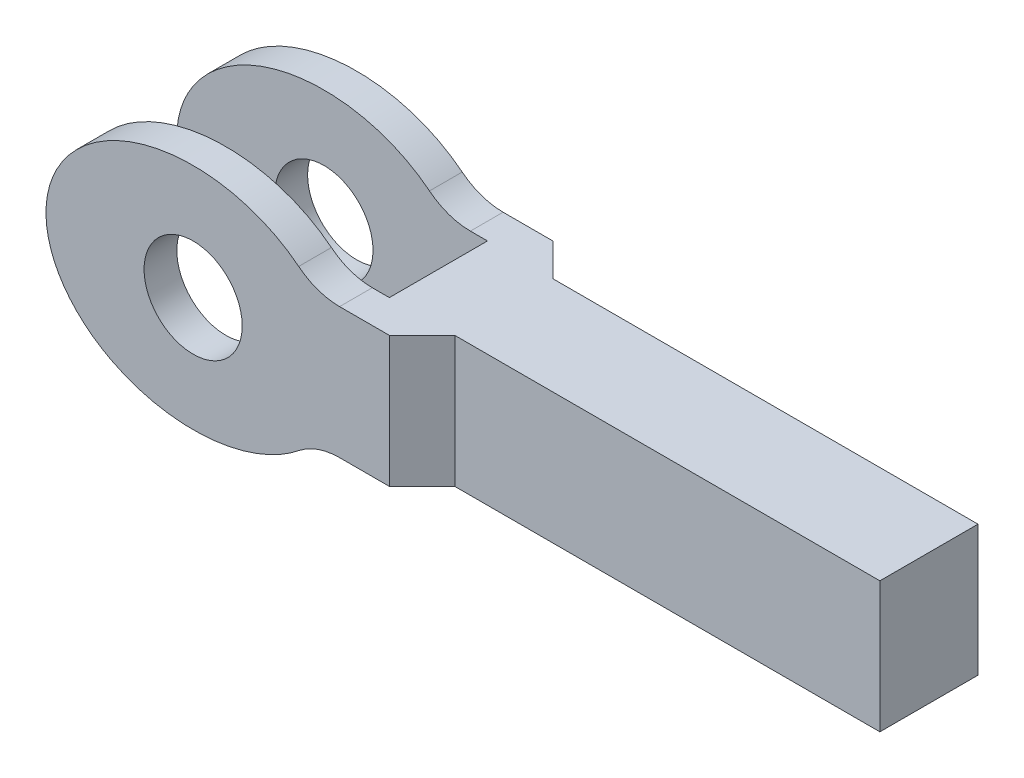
ISO-10303-21;
HEADER;
FILE_DESCRIPTION(('STEP AP214'),'2;1');
FILE_NAME('part.step','',(''),(''),'','','');
FILE_SCHEMA(('AUTOMOTIVE_DESIGN { 1 0 10303 214 1 1 1 1 }'));
ENDSEC;
DATA;
#1=APPLICATION_CONTEXT('core data for automotive mechanical design processes');
#2=APPLICATION_PROTOCOL_DEFINITION('international standard','automotive_design',2000,#1);
#3=PRODUCT_CONTEXT('',#1,'mechanical');
#4=PRODUCT('Part','Part','',(#3));
#5=PRODUCT_RELATED_PRODUCT_CATEGORY('part','',(#4));
#6=PRODUCT_DEFINITION_FORMATION('','',#4);
#7=PRODUCT_DEFINITION_CONTEXT('part definition',#1,'design');
#8=PRODUCT_DEFINITION('design','',#6,#7);
#9=PRODUCT_DEFINITION_SHAPE('','',#8);
#10=(LENGTH_UNIT() NAMED_UNIT(*) SI_UNIT(.MILLI.,.METRE.));
#11=(NAMED_UNIT(*) PLANE_ANGLE_UNIT() SI_UNIT($,.RADIAN.));
#12=(NAMED_UNIT(*) SI_UNIT($,.STERADIAN.) SOLID_ANGLE_UNIT());
#13=UNCERTAINTY_MEASURE_WITH_UNIT(LENGTH_MEASURE(1.E-05),#10,'distance_accuracy_value','');
#14=(GEOMETRIC_REPRESENTATION_CONTEXT(3) GLOBAL_UNCERTAINTY_ASSIGNED_CONTEXT((#13)) GLOBAL_UNIT_ASSIGNED_CONTEXT((#10,
#11,#12)) REPRESENTATION_CONTEXT('',''));
#15=CARTESIAN_POINT('',(0.,0.,0.));
#16=DIRECTION('',(0.,0.,1.));
#17=DIRECTION('',(1.,0.,0.));
#18=AXIS2_PLACEMENT_3D('',#15,#16,#17);
#19=CARTESIAN_POINT('',(4.47775645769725,-4.00000000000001,2.5));
#20=DIRECTION('',(0.,0.,-1.));
#21=DIRECTION('',(-1.,0.,0.));
#22=AXIS2_PLACEMENT_3D('',#19,#20,#21);
#23=CYLINDRICAL_SURFACE('',#22,2.);
#24=DIRECTION('',(0.,0.,-1.));
#25=VECTOR('',#24,1.);
#26=CARTESIAN_POINT('',(4.47775645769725,-2.,2.5));
#27=LINE('',#26,#25);
#28=CARTESIAN_POINT('',(4.47775645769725,-2.,-1.5));
#29=VERTEX_POINT('',#28);
#30=CARTESIAN_POINT('',(4.47775645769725,-2.,-2.5));
#31=VERTEX_POINT('',#30);
#32=EDGE_CURVE('E167',#29,#31,#27,.T.);
#33=ORIENTED_EDGE('',*,*,#32,.F.);
#34=CARTESIAN_POINT('',(4.47775645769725,-4.00000000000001,-1.5));
#35=DIRECTION('',(0.,0.,-1.));
#36=DIRECTION('',(-1.,0.,0.));
#37=AXIS2_PLACEMENT_3D('',#34,#35,#36);
#38=CIRCLE('',#37,2.);
#39=CARTESIAN_POINT('',(3.2277484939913,-2.43875687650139,-1.5));
#40=VERTEX_POINT('',#39);
#41=EDGE_CURVE('E237',#29,#40,#38,.F.);
#42=ORIENTED_EDGE('',*,*,#41,.T.);
#43=DIRECTION('',(0.,0.,-1.));
#44=VECTOR('',#43,1.);
#45=CARTESIAN_POINT('',(3.2277484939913,-2.43875687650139,2.5));
#46=LINE('',#45,#44);
#47=CARTESIAN_POINT('',(3.2277484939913,-2.43875687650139,-2.5));
#48=VERTEX_POINT('',#47);
#49=EDGE_CURVE('E267',#40,#48,#46,.T.);
#50=ORIENTED_EDGE('',*,*,#49,.T.);
#51=CARTESIAN_POINT('',(4.47775645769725,-4.00000000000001,-2.5));
#52=DIRECTION('',(0.,0.,-1.));
#53=DIRECTION('',(1.,0.,0.));
#54=AXIS2_PLACEMENT_3D('',#51,#52,#53);
#55=CIRCLE('',#54,2.);
#56=EDGE_CURVE('E250',#48,#31,#55,.T.);
#57=ORIENTED_EDGE('',*,*,#56,.T.);
#58=EDGE_LOOP('',(#33,#42,#50,#57));
#59=FACE_BOUND('',#58,.T.);
#60=ADVANCED_FACE('F33',(#59),#23,.F.);
#61=CARTESIAN_POINT('',(4.47775645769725,4.00000000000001,2.5));
#62=DIRECTION('',(0.,0.,-1.));
#63=DIRECTION('',(-1.,0.,0.));
#64=AXIS2_PLACEMENT_3D('',#61,#62,#63);
#65=CYLINDRICAL_SURFACE('',#64,2.);
#66=DIRECTION('',(0.,0.,-1.));
#67=VECTOR('',#66,1.);
#68=CARTESIAN_POINT('',(3.2277484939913,2.43875687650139,2.5));
#69=LINE('',#68,#67);
#70=CARTESIAN_POINT('',(3.2277484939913,2.43875687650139,-1.5));
#71=VERTEX_POINT('',#70);
#72=CARTESIAN_POINT('',(3.2277484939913,2.43875687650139,-2.5));
#73=VERTEX_POINT('',#72);
#74=EDGE_CURVE('E320',#71,#73,#69,.T.);
#75=ORIENTED_EDGE('',*,*,#74,.F.);
#76=CARTESIAN_POINT('',(4.47775645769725,4.00000000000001,-1.5));
#77=DIRECTION('',(0.,0.,-1.));
#78=DIRECTION('',(-1.,0.,0.));
#79=AXIS2_PLACEMENT_3D('',#76,#77,#78);
#80=CIRCLE('',#79,2.);
#81=CARTESIAN_POINT('',(4.47775645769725,2.,-1.5));
#82=VERTEX_POINT('',#81);
#83=EDGE_CURVE('E231',#71,#82,#80,.F.);
#84=ORIENTED_EDGE('',*,*,#83,.T.);
#85=DIRECTION('',(0.,0.,-1.));
#86=VECTOR('',#85,1.);
#87=CARTESIAN_POINT('',(4.47775645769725,2.,2.5));
#88=LINE('',#87,#86);
#89=CARTESIAN_POINT('',(4.47775645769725,2.,-2.5));
#90=VERTEX_POINT('',#89);
#91=EDGE_CURVE('E323',#82,#90,#88,.T.);
#92=ORIENTED_EDGE('',*,*,#91,.T.);
#93=CARTESIAN_POINT('',(4.47775645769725,4.00000000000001,-2.5));
#94=DIRECTION('',(0.,0.,-1.));
#95=DIRECTION('',(-1.,0.,0.));
#96=AXIS2_PLACEMENT_3D('',#93,#94,#95);
#97=CIRCLE('',#96,2.);
#98=EDGE_CURVE('E310',#90,#73,#97,.T.);
#99=ORIENTED_EDGE('',*,*,#98,.T.);
#100=EDGE_LOOP('',(#75,#84,#92,#99));
#101=FACE_BOUND('',#100,.T.);
#102=ADVANCED_FACE('F283',(#101),#65,.F.);
#103=CARTESIAN_POINT('',(0.,0.,2.5));
#104=DIRECTION('',(0.,0.,1.));
#105=DIRECTION('',(-1.,0.,0.));
#106=AXIS2_PLACEMENT_3D('',#103,#104,#105);
#107=ELLIPSE('',#106,4.5,3.5);
#108=DIRECTION('',(0.,0.,-1.));
#109=VECTOR('',#108,1.);
#110=SURFACE_OF_LINEAR_EXTRUSION('',#107,#109);
#111=CARTESIAN_POINT('',(0.,0.,-1.5));
#112=DIRECTION('',(0.,0.,1.));
#113=DIRECTION('',(-1.,0.,0.));
#114=AXIS2_PLACEMENT_3D('',#111,#112,#113);
#115=ELLIPSE('',#114,4.5,3.5);
#116=EDGE_CURVE('E185',#40,#71,#115,.F.);
#117=ORIENTED_EDGE('',*,*,#116,.T.);
#118=ORIENTED_EDGE('',*,*,#74,.T.);
#119=CARTESIAN_POINT('',(0.,0.,-2.5));
#120=DIRECTION('',(0.,0.,1.));
#121=DIRECTION('',(-1.,0.,0.));
#122=AXIS2_PLACEMENT_3D('',#119,#120,#121);
#123=ELLIPSE('',#122,4.5,3.5);
#124=EDGE_CURVE('E257',#73,#48,#123,.T.);
#125=ORIENTED_EDGE('',*,*,#124,.T.);
#126=ORIENTED_EDGE('',*,*,#49,.F.);
#127=EDGE_LOOP('',(#117,#118,#125,#126));
#128=FACE_BOUND('',#127,.T.);
#129=ADVANCED_FACE('F277',(#128),#110,.F.);
#130=CARTESIAN_POINT('',(0.,0.,2.5));
#131=DIRECTION('',(0.,0.,-1.));
#132=DIRECTION('',(-1.,0.,0.));
#133=AXIS2_PLACEMENT_3D('',#130,#131,#132);
#134=CYLINDRICAL_SURFACE('',#133,1.5);
#135=CARTESIAN_POINT('',(0.,0.,-1.5));
#136=DIRECTION('',(0.,0.,-1.));
#137=DIRECTION('',(-1.,0.,0.));
#138=AXIS2_PLACEMENT_3D('',#135,#136,#137);
#139=CIRCLE('',#138,1.5);
#140=CARTESIAN_POINT('',(-1.5,0.,-1.5));
#141=VERTEX_POINT('',#140);
#142=EDGE_CURVE('E182',#141,#141,#139,.T.);
#143=ORIENTED_EDGE('',*,*,#142,.F.);
#144=EDGE_LOOP('',(#143));
#145=FACE_BOUND('',#144,.T.);
#146=CARTESIAN_POINT('',(0.,0.,-2.5));
#147=DIRECTION('',(0.,0.,1.));
#148=DIRECTION('',(1.,0.,0.));
#149=AXIS2_PLACEMENT_3D('',#146,#147,#148);
#150=CIRCLE('',#149,1.5);
#151=CARTESIAN_POINT('',(1.5,0.,-2.5));
#152=VERTEX_POINT('',#151);
#153=EDGE_CURVE('E246',#152,#152,#150,.T.);
#154=ORIENTED_EDGE('',*,*,#153,.F.);
#155=EDGE_LOOP('',(#154));
#156=FACE_BOUND('',#155,.T.);
#157=ADVANCED_FACE('F351',(#145,#156),#134,.F.);
#158=CARTESIAN_POINT('',(0.,0.,2.5));
#159=DIRECTION('',(0.,0.,1.));
#160=DIRECTION('',(1.,0.,0.));
#161=AXIS2_PLACEMENT_3D('',#158,#159,#160);
#162=PLANE('',#161);
#163=DIRECTION('',(0.,1.,0.));
#164=VECTOR('',#163,1.);
#165=CARTESIAN_POINT('',(6.,-3.5,2.5));
#166=LINE('',#165,#164);
#167=CARTESIAN_POINT('',(6.,-2.,2.5));
#168=VERTEX_POINT('',#167);
#169=CARTESIAN_POINT('',(6.,2.,2.5));
#170=VERTEX_POINT('',#169);
#171=EDGE_CURVE('E153',#168,#170,#166,.T.);
#172=ORIENTED_EDGE('',*,*,#171,.T.);
#173=DIRECTION('',(-1.,0.,0.));
#174=VECTOR('',#173,1.);
#175=CARTESIAN_POINT('',(4.47775645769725,2.,2.5));
#176=LINE('',#175,#174);
#177=CARTESIAN_POINT('',(4.47775645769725,2.,2.5));
#178=VERTEX_POINT('',#177);
#179=EDGE_CURVE('E260',#170,#178,#176,.T.);
#180=ORIENTED_EDGE('',*,*,#179,.T.);
#181=CARTESIAN_POINT('',(4.47775645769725,4.00000000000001,2.5));
#182=DIRECTION('',(0.,0.,-1.));
#183=DIRECTION('',(-1.,0.,0.));
#184=AXIS2_PLACEMENT_3D('',#181,#182,#183);
#185=CIRCLE('',#184,2.);
#186=CARTESIAN_POINT('',(3.2277484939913,2.43875687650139,2.5));
#187=VERTEX_POINT('',#186);
#188=EDGE_CURVE('E262',#178,#187,#185,.T.);
#189=ORIENTED_EDGE('',*,*,#188,.T.);
#190=CARTESIAN_POINT('',(3.2277484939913,-2.43875687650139,2.5));
#191=VERTEX_POINT('',#190);
#192=EDGE_CURVE('E264',#187,#191,#107,.T.);
#193=ORIENTED_EDGE('',*,*,#192,.T.);
#194=CARTESIAN_POINT('',(4.47775645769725,-4.00000000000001,2.5));
#195=DIRECTION('',(0.,0.,-1.));
#196=DIRECTION('',(1.,0.,0.));
#197=AXIS2_PLACEMENT_3D('',#194,#195,#196);
#198=CIRCLE('',#197,2.);
#199=CARTESIAN_POINT('',(4.47775645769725,-2.,2.5));
#200=VERTEX_POINT('',#199);
#201=EDGE_CURVE('E253',#191,#200,#198,.T.);
#202=ORIENTED_EDGE('',*,*,#201,.T.);
#203=DIRECTION('',(1.,0.,0.));
#204=VECTOR('',#203,1.);
#205=CARTESIAN_POINT('',(20.,-2.,2.5));
#206=LINE('',#205,#204);
#207=EDGE_CURVE('E256',#200,#168,#206,.T.);
#208=ORIENTED_EDGE('',*,*,#207,.T.);
#209=EDGE_LOOP('',(#172,#180,#189,#193,#202,#208));
#210=FACE_BOUND('',#209,.T.);
#211=CARTESIAN_POINT('',(0.,0.,2.5));
#212=DIRECTION('',(0.,0.,1.));
#213=DIRECTION('',(1.,0.,0.));
#214=AXIS2_PLACEMENT_3D('',#211,#212,#213);
#215=CIRCLE('',#214,1.5);
#216=CARTESIAN_POINT('',(1.5,0.,2.5));
#217=VERTEX_POINT('',#216);
#218=EDGE_CURVE('E247',#217,#217,#215,.T.);
#219=ORIENTED_EDGE('',*,*,#218,.F.);
#220=EDGE_LOOP('',(#219));
#221=FACE_BOUND('',#220,.T.);
#222=ADVANCED_FACE('F348',(#210,#221),#162,.T.);
#223=CARTESIAN_POINT('',(0.,0.,-2.5));
#224=DIRECTION('',(0.,0.,1.));
#225=DIRECTION('',(1.,0.,0.));
#226=AXIS2_PLACEMENT_3D('',#223,#224,#225);
#227=PLANE('',#226);
#228=DIRECTION('',(-1.,0.,0.));
#229=VECTOR('',#228,1.);
#230=CARTESIAN_POINT('',(4.47775645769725,2.,-2.5));
#231=LINE('',#230,#229);
#232=CARTESIAN_POINT('',(6.,2.,-2.5));
#233=VERTEX_POINT('',#232);
#234=EDGE_CURVE('E309',#233,#90,#231,.T.);
#235=ORIENTED_EDGE('',*,*,#234,.F.);
#236=DIRECTION('',(0.,1.,0.));
#237=VECTOR('',#236,1.);
#238=CARTESIAN_POINT('',(6.,-3.5,-2.5));
#239=LINE('',#238,#237);
#240=CARTESIAN_POINT('',(6.,-2.,-2.5));
#241=VERTEX_POINT('',#240);
#242=EDGE_CURVE('E56',#241,#233,#239,.T.);
#243=ORIENTED_EDGE('',*,*,#242,.F.);
#244=DIRECTION('',(1.,0.,0.));
#245=VECTOR('',#244,1.);
#246=CARTESIAN_POINT('',(20.,-2.,-2.5));
#247=LINE('',#246,#245);
#248=EDGE_CURVE('E304',#31,#241,#247,.T.);
#249=ORIENTED_EDGE('',*,*,#248,.F.);
#250=ORIENTED_EDGE('',*,*,#56,.F.);
#251=ORIENTED_EDGE('',*,*,#124,.F.);
#252=ORIENTED_EDGE('',*,*,#98,.F.);
#253=EDGE_LOOP('',(#235,#243,#249,#250,#251,#252));
#254=FACE_BOUND('',#253,.T.);
#255=ORIENTED_EDGE('',*,*,#153,.T.);
#256=EDGE_LOOP('',(#255));
#257=FACE_BOUND('',#256,.T.);
#258=ADVANCED_FACE('F278',(#254,#257),#227,.F.);
#259=CARTESIAN_POINT('',(3.2277484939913,-2.43875687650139,1.5));
#260=VERTEX_POINT('',#259);
#261=EDGE_CURVE('E317',#191,#260,#46,.T.);
#262=ORIENTED_EDGE('',*,*,#261,.T.);
#263=CARTESIAN_POINT('',(4.47775645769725,-4.00000000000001,1.5));
#264=DIRECTION('',(0.,0.,1.));
#265=DIRECTION('',(1.,0.,0.));
#266=AXIS2_PLACEMENT_3D('',#263,#264,#265);
#267=CIRCLE('',#266,2.);
#268=CARTESIAN_POINT('',(4.47775645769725,-2.,1.5));
#269=VERTEX_POINT('',#268);
#270=EDGE_CURVE('E225',#260,#269,#267,.F.);
#271=ORIENTED_EDGE('',*,*,#270,.T.);
#272=EDGE_CURVE('E169',#200,#269,#27,.T.);
#273=ORIENTED_EDGE('',*,*,#272,.F.);
#274=ORIENTED_EDGE('',*,*,#201,.F.);
#275=EDGE_LOOP('',(#262,#271,#273,#274));
#276=FACE_BOUND('',#275,.T.);
#277=ADVANCED_FACE('F35',(#276),#23,.F.);
#278=CARTESIAN_POINT('',(20.,-2.,2.5));
#279=DIRECTION('',(0.,1.,0.));
#280=DIRECTION('',(0.,0.,1.));
#281=AXIS2_PLACEMENT_3D('',#278,#279,#280);
#282=PLANE('',#281);
#283=DIRECTION('',(-1.,0.,0.));
#284=VECTOR('',#283,1.);
#285=CARTESIAN_POINT('',(20.,-2.,1.5));
#286=LINE('',#285,#284);
#287=CARTESIAN_POINT('',(20.,-2.,1.5));
#288=VERTEX_POINT('',#287);
#289=CARTESIAN_POINT('',(7.00000000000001,-2.,1.5));
#290=VERTEX_POINT('',#289);
#291=EDGE_CURVE('E145',#288,#290,#286,.T.);
#292=ORIENTED_EDGE('',*,*,#291,.T.);
#293=DIRECTION('',(-0.707106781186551,0.,0.707106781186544));
#294=VECTOR('',#293,1.);
#295=CARTESIAN_POINT('',(13.0000000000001,-2.,-4.5));
#296=LINE('',#295,#294);
#297=EDGE_CURVE('E152',#290,#168,#296,.T.);
#298=ORIENTED_EDGE('',*,*,#297,.T.);
#299=ORIENTED_EDGE('',*,*,#207,.F.);
#300=ORIENTED_EDGE('',*,*,#272,.T.);
#301=DIRECTION('',(1.,0.,0.));
#302=VECTOR('',#301,1.);
#303=CARTESIAN_POINT('',(20.,-2.,1.5));
#304=LINE('',#303,#302);
#305=CARTESIAN_POINT('',(5.,-2.,1.5));
#306=VERTEX_POINT('',#305);
#307=EDGE_CURVE('E186',#269,#306,#304,.T.);
#308=ORIENTED_EDGE('',*,*,#307,.T.);
#309=DIRECTION('',(0.,0.,-1.));
#310=VECTOR('',#309,1.);
#311=CARTESIAN_POINT('',(5.,-2.,2.5));
#312=LINE('',#311,#310);
#313=CARTESIAN_POINT('',(5.,-2.,-1.5));
#314=VERTEX_POINT('',#313);
#315=EDGE_CURVE('E243',#306,#314,#312,.T.);
#316=ORIENTED_EDGE('',*,*,#315,.T.);
#317=DIRECTION('',(-1.,0.,0.));
#318=VECTOR('',#317,1.);
#319=CARTESIAN_POINT('',(20.,-2.,-1.5));
#320=LINE('',#319,#318);
#321=EDGE_CURVE('E240',#314,#29,#320,.T.);
#322=ORIENTED_EDGE('',*,*,#321,.T.);
#323=ORIENTED_EDGE('',*,*,#32,.T.);
#324=ORIENTED_EDGE('',*,*,#248,.T.);
#325=DIRECTION('',(0.707106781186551,0.,0.707106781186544));
#326=VECTOR('',#325,1.);
#327=CARTESIAN_POINT('',(15.5000000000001,-2.,6.99999999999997));
#328=LINE('',#327,#326);
#329=CARTESIAN_POINT('',(7.00000000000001,-2.,-1.5));
#330=VERTEX_POINT('',#329);
#331=EDGE_CURVE('E206',#241,#330,#328,.T.);
#332=ORIENTED_EDGE('',*,*,#331,.T.);
#333=DIRECTION('',(1.,0.,0.));
#334=VECTOR('',#333,1.);
#335=CARTESIAN_POINT('',(20.,-2.,-1.5));
#336=LINE('',#335,#334);
#337=CARTESIAN_POINT('',(20.,-2.,-1.5));
#338=VERTEX_POINT('',#337);
#339=EDGE_CURVE('E166',#330,#338,#336,.T.);
#340=ORIENTED_EDGE('',*,*,#339,.T.);
#341=DIRECTION('',(0.,0.,-1.));
#342=VECTOR('',#341,1.);
#343=CARTESIAN_POINT('',(20.,-2.,2.5));
#344=LINE('',#343,#342);
#345=EDGE_CURVE('E159',#288,#338,#344,.T.);
#346=ORIENTED_EDGE('',*,*,#345,.F.);
#347=EDGE_LOOP('',(#292,#298,#299,#300,#308,#316,#322,#323,#324,#332,#340,#346));
#348=FACE_BOUND('',#347,.T.);
#349=ADVANCED_FACE('F164',(#348),#282,.F.);
#350=CARTESIAN_POINT('',(20.,2.,2.5));
#351=DIRECTION('',(-1.,0.,0.));
#352=DIRECTION('',(0.,0.,1.));
#353=AXIS2_PLACEMENT_3D('',#350,#351,#352);
#354=PLANE('',#353);
#355=DIRECTION('',(0.,0.,-1.));
#356=VECTOR('',#355,1.);
#357=CARTESIAN_POINT('',(20.,2.,2.5));
#358=LINE('',#357,#356);
#359=CARTESIAN_POINT('',(20.,2.,1.5));
#360=VERTEX_POINT('',#359);
#361=CARTESIAN_POINT('',(20.,2.,-1.5));
#362=VERTEX_POINT('',#361);
#363=EDGE_CURVE('E161',#360,#362,#358,.T.);
#364=ORIENTED_EDGE('',*,*,#363,.F.);
#365=DIRECTION('',(0.,1.,0.));
#366=VECTOR('',#365,1.);
#367=CARTESIAN_POINT('',(20.,-3.5,1.5));
#368=LINE('',#367,#366);
#369=EDGE_CURVE('E48',#288,#360,#368,.T.);
#370=ORIENTED_EDGE('',*,*,#369,.F.);
#371=ORIENTED_EDGE('',*,*,#345,.T.);
#372=DIRECTION('',(0.,1.,0.));
#373=VECTOR('',#372,1.);
#374=CARTESIAN_POINT('',(20.,-3.5,-1.5));
#375=LINE('',#374,#373);
#376=EDGE_CURVE('E204',#338,#362,#375,.T.);
#377=ORIENTED_EDGE('',*,*,#376,.T.);
#378=EDGE_LOOP('',(#364,#370,#371,#377));
#379=FACE_BOUND('',#378,.T.);
#380=ADVANCED_FACE('F157',(#379),#354,.F.);
#381=CARTESIAN_POINT('',(4.47775645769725,2.,2.5));
#382=DIRECTION('',(0.,-1.,0.));
#383=DIRECTION('',(0.,0.,-1.));
#384=AXIS2_PLACEMENT_3D('',#381,#382,#383);
#385=PLANE('',#384);
#386=ORIENTED_EDGE('',*,*,#179,.F.);
#387=DIRECTION('',(0.707106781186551,0.,-0.707106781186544));
#388=VECTOR('',#387,1.);
#389=CARTESIAN_POINT('',(5.23887822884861,2.,3.26112177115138));
#390=LINE('',#389,#388);
#391=CARTESIAN_POINT('',(7.00000000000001,2.,1.5));
#392=VERTEX_POINT('',#391);
#393=EDGE_CURVE('E11',#170,#392,#390,.T.);
#394=ORIENTED_EDGE('',*,*,#393,.T.);
#395=DIRECTION('',(1.,0.,0.));
#396=VECTOR('',#395,1.);
#397=CARTESIAN_POINT('',(4.47775645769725,2.,1.5));
#398=LINE('',#397,#396);
#399=EDGE_CURVE('E41',#392,#360,#398,.T.);
#400=ORIENTED_EDGE('',*,*,#399,.T.);
#401=ORIENTED_EDGE('',*,*,#363,.T.);
#402=DIRECTION('',(-1.,0.,0.));
#403=VECTOR('',#402,1.);
#404=CARTESIAN_POINT('',(4.47775645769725,2.,-1.5));
#405=LINE('',#404,#403);
#406=CARTESIAN_POINT('',(7.00000000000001,2.,-1.5));
#407=VERTEX_POINT('',#406);
#408=EDGE_CURVE('E191',#362,#407,#405,.T.);
#409=ORIENTED_EDGE('',*,*,#408,.T.);
#410=DIRECTION('',(-0.707106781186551,0.,-0.707106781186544));
#411=VECTOR('',#410,1.);
#412=CARTESIAN_POINT('',(7.73887822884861,2.,-0.761121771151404));
#413=LINE('',#412,#411);
#414=EDGE_CURVE('E189',#407,#233,#413,.T.);
#415=ORIENTED_EDGE('',*,*,#414,.T.);
#416=ORIENTED_EDGE('',*,*,#234,.T.);
#417=ORIENTED_EDGE('',*,*,#91,.F.);
#418=DIRECTION('',(1.,0.,0.));
#419=VECTOR('',#418,1.);
#420=CARTESIAN_POINT('',(4.47775645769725,2.,-1.5));
#421=LINE('',#420,#419);
#422=CARTESIAN_POINT('',(5.,2.,-1.5));
#423=VERTEX_POINT('',#422);
#424=EDGE_CURVE('E234',#82,#423,#421,.T.);
#425=ORIENTED_EDGE('',*,*,#424,.T.);
#426=DIRECTION('',(0.,0.,1.));
#427=VECTOR('',#426,1.);
#428=CARTESIAN_POINT('',(5.,2.,2.5));
#429=LINE('',#428,#427);
#430=CARTESIAN_POINT('',(5.,2.,1.5));
#431=VERTEX_POINT('',#430);
#432=EDGE_CURVE('E176',#423,#431,#429,.T.);
#433=ORIENTED_EDGE('',*,*,#432,.T.);
#434=DIRECTION('',(-1.,0.,0.));
#435=VECTOR('',#434,1.);
#436=CARTESIAN_POINT('',(4.47775645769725,2.,1.5));
#437=LINE('',#436,#435);
#438=CARTESIAN_POINT('',(4.47775645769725,2.,1.5));
#439=VERTEX_POINT('',#438);
#440=EDGE_CURVE('E222',#431,#439,#437,.T.);
#441=ORIENTED_EDGE('',*,*,#440,.T.);
#442=EDGE_CURVE('E171',#178,#439,#88,.T.);
#443=ORIENTED_EDGE('',*,*,#442,.F.);
#444=EDGE_LOOP('',(#386,#394,#400,#401,#409,#415,#416,#417,#425,#433,#441,#443));
#445=FACE_BOUND('',#444,.T.);
#446=ADVANCED_FACE('F195',(#445),#385,.F.);
#447=ORIENTED_EDGE('',*,*,#442,.T.);
#448=CARTESIAN_POINT('',(4.47775645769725,4.00000000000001,1.5));
#449=DIRECTION('',(0.,0.,1.));
#450=DIRECTION('',(1.,0.,0.));
#451=AXIS2_PLACEMENT_3D('',#448,#449,#450);
#452=CIRCLE('',#451,2.);
#453=CARTESIAN_POINT('',(3.2277484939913,2.43875687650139,1.5));
#454=VERTEX_POINT('',#453);
#455=EDGE_CURVE('E219',#439,#454,#452,.F.);
#456=ORIENTED_EDGE('',*,*,#455,.T.);
#457=EDGE_CURVE('E321',#187,#454,#69,.T.);
#458=ORIENTED_EDGE('',*,*,#457,.F.);
#459=ORIENTED_EDGE('',*,*,#188,.F.);
#460=EDGE_LOOP('',(#447,#456,#458,#459));
#461=FACE_BOUND('',#460,.T.);
#462=ADVANCED_FACE('F275',(#461),#65,.F.);
#463=ORIENTED_EDGE('',*,*,#457,.T.);
#464=CARTESIAN_POINT('',(0.,0.,1.5));
#465=DIRECTION('',(0.,0.,1.));
#466=DIRECTION('',(-1.,0.,0.));
#467=AXIS2_PLACEMENT_3D('',#464,#465,#466);
#468=ELLIPSE('',#467,4.5,3.5);
#469=EDGE_CURVE('E180',#454,#260,#468,.T.);
#470=ORIENTED_EDGE('',*,*,#469,.T.);
#471=ORIENTED_EDGE('',*,*,#261,.F.);
#472=ORIENTED_EDGE('',*,*,#192,.F.);
#473=EDGE_LOOP('',(#463,#470,#471,#472));
#474=FACE_BOUND('',#473,.T.);
#475=ADVANCED_FACE('F270',(#474),#110,.F.);
#476=CARTESIAN_POINT('',(0.,0.,1.5));
#477=DIRECTION('',(0.,0.,1.));
#478=DIRECTION('',(1.,0.,0.));
#479=AXIS2_PLACEMENT_3D('',#476,#477,#478);
#480=CIRCLE('',#479,1.5);
#481=CARTESIAN_POINT('',(1.5,0.,1.5));
#482=VERTEX_POINT('',#481);
#483=EDGE_CURVE('E177',#482,#482,#480,.T.);
#484=ORIENTED_EDGE('',*,*,#483,.F.);
#485=EDGE_LOOP('',(#484));
#486=FACE_BOUND('',#485,.T.);
#487=ORIENTED_EDGE('',*,*,#218,.T.);
#488=EDGE_LOOP('',(#487));
#489=FACE_BOUND('',#488,.T.);
#490=ADVANCED_FACE('F274',(#486,#489),#134,.F.);
#491=CARTESIAN_POINT('',(5.,-3.5,1.5));
#492=DIRECTION('',(1.,0.,0.));
#493=DIRECTION('',(0.,0.,-1.));
#494=AXIS2_PLACEMENT_3D('',#491,#492,#493);
#495=PLANE('',#494);
#496=DIRECTION('',(0.,1.,0.));
#497=VECTOR('',#496,1.);
#498=CARTESIAN_POINT('',(5.,-3.5,1.5));
#499=LINE('',#498,#497);
#500=EDGE_CURVE('E213',#306,#431,#499,.T.);
#501=ORIENTED_EDGE('',*,*,#500,.T.);
#502=ORIENTED_EDGE('',*,*,#432,.F.);
#503=DIRECTION('',(0.,1.,0.));
#504=VECTOR('',#503,1.);
#505=CARTESIAN_POINT('',(5.,-3.5,-1.5));
#506=LINE('',#505,#504);
#507=EDGE_CURVE('E181',#314,#423,#506,.T.);
#508=ORIENTED_EDGE('',*,*,#507,.F.);
#509=ORIENTED_EDGE('',*,*,#315,.F.);
#510=EDGE_LOOP('',(#501,#502,#508,#509));
#511=FACE_BOUND('',#510,.T.);
#512=ADVANCED_FACE('F337',(#511),#495,.F.);
#513=CARTESIAN_POINT('',(5.,-3.5,-1.5));
#514=DIRECTION('',(0.,0.,-1.));
#515=DIRECTION('',(-1.,0.,0.));
#516=AXIS2_PLACEMENT_3D('',#513,#514,#515);
#517=PLANE('',#516);
#518=ORIENTED_EDGE('',*,*,#142,.T.);
#519=EDGE_LOOP('',(#518));
#520=FACE_BOUND('',#519,.T.);
#521=ORIENTED_EDGE('',*,*,#507,.T.);
#522=ORIENTED_EDGE('',*,*,#424,.F.);
#523=ORIENTED_EDGE('',*,*,#83,.F.);
#524=ORIENTED_EDGE('',*,*,#116,.F.);
#525=ORIENTED_EDGE('',*,*,#41,.F.);
#526=ORIENTED_EDGE('',*,*,#321,.F.);
#527=EDGE_LOOP('',(#521,#522,#523,#524,#525,#526));
#528=FACE_BOUND('',#527,.T.);
#529=ADVANCED_FACE('F334',(#520,#528),#517,.F.);
#530=CARTESIAN_POINT('',(5.,-3.5,1.5));
#531=DIRECTION('',(0.,0.,1.));
#532=DIRECTION('',(1.,0.,0.));
#533=AXIS2_PLACEMENT_3D('',#530,#531,#532);
#534=PLANE('',#533);
#535=ORIENTED_EDGE('',*,*,#483,.T.);
#536=EDGE_LOOP('',(#535));
#537=FACE_BOUND('',#536,.T.);
#538=ORIENTED_EDGE('',*,*,#270,.F.);
#539=ORIENTED_EDGE('',*,*,#469,.F.);
#540=ORIENTED_EDGE('',*,*,#455,.F.);
#541=ORIENTED_EDGE('',*,*,#440,.F.);
#542=ORIENTED_EDGE('',*,*,#500,.F.);
#543=ORIENTED_EDGE('',*,*,#307,.F.);
#544=EDGE_LOOP('',(#538,#539,#540,#541,#542,#543));
#545=FACE_BOUND('',#544,.T.);
#546=ADVANCED_FACE('F341',(#537,#545),#534,.F.);
#547=CARTESIAN_POINT('',(7.00000000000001,-3.5,-1.5));
#548=DIRECTION('',(0.,0.,1.));
#549=DIRECTION('',(1.,0.,0.));
#550=AXIS2_PLACEMENT_3D('',#547,#548,#549);
#551=PLANE('',#550);
#552=DIRECTION('',(0.,1.,0.));
#553=VECTOR('',#552,1.);
#554=CARTESIAN_POINT('',(7.00000000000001,-3.5,-1.5));
#555=LINE('',#554,#553);
#556=EDGE_CURVE('E207',#330,#407,#555,.T.);
#557=ORIENTED_EDGE('',*,*,#556,.T.);
#558=ORIENTED_EDGE('',*,*,#408,.F.);
#559=ORIENTED_EDGE('',*,*,#376,.F.);
#560=ORIENTED_EDGE('',*,*,#339,.F.);
#561=EDGE_LOOP('',(#557,#558,#559,#560));
#562=FACE_BOUND('',#561,.T.);
#563=ADVANCED_FACE('F425',(#562),#551,.F.);
#564=CARTESIAN_POINT('',(6.,-3.5,-2.5));
#565=DIRECTION('',(-0.707106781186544,0.,0.707106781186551));
#566=DIRECTION('',(0.707106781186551,0.,0.707106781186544));
#567=AXIS2_PLACEMENT_3D('',#564,#565,#566);
#568=PLANE('',#567);
#569=ORIENTED_EDGE('',*,*,#242,.T.);
#570=ORIENTED_EDGE('',*,*,#414,.F.);
#571=ORIENTED_EDGE('',*,*,#556,.F.);
#572=ORIENTED_EDGE('',*,*,#331,.F.);
#573=EDGE_LOOP('',(#569,#570,#571,#572));
#574=FACE_BOUND('',#573,.T.);
#575=ADVANCED_FACE('F441',(#574),#568,.F.);
#576=CARTESIAN_POINT('',(6.,-3.5,2.5));
#577=DIRECTION('',(-0.707106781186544,0.,-0.707106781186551));
#578=DIRECTION('',(-0.707106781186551,0.,0.707106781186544));
#579=AXIS2_PLACEMENT_3D('',#576,#577,#578);
#580=PLANE('',#579);
#581=DIRECTION('',(0.,1.,0.));
#582=VECTOR('',#581,1.);
#583=CARTESIAN_POINT('',(7.00000000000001,-3.5,1.5));
#584=LINE('',#583,#582);
#585=EDGE_CURVE('E148',#290,#392,#584,.T.);
#586=ORIENTED_EDGE('',*,*,#585,.T.);
#587=ORIENTED_EDGE('',*,*,#393,.F.);
#588=ORIENTED_EDGE('',*,*,#171,.F.);
#589=ORIENTED_EDGE('',*,*,#297,.F.);
#590=EDGE_LOOP('',(#586,#587,#588,#589));
#591=FACE_BOUND('',#590,.T.);
#592=ADVANCED_FACE('F198',(#591),#580,.F.);
#593=CARTESIAN_POINT('',(7.00000000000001,-3.5,1.5));
#594=DIRECTION('',(0.,0.,-1.));
#595=DIRECTION('',(-1.,0.,0.));
#596=AXIS2_PLACEMENT_3D('',#593,#594,#595);
#597=PLANE('',#596);
#598=ORIENTED_EDGE('',*,*,#369,.T.);
#599=ORIENTED_EDGE('',*,*,#399,.F.);
#600=ORIENTED_EDGE('',*,*,#585,.F.);
#601=ORIENTED_EDGE('',*,*,#291,.F.);
#602=EDGE_LOOP('',(#598,#599,#600,#601));
#603=FACE_BOUND('',#602,.T.);
#604=ADVANCED_FACE('F146',(#603),#597,.F.);
#605=CLOSED_SHELL('',(#60,#102,#129,#157,#222,#258,#277,#349,#380,#446,#462,#475,#490,#512,#529,
#546,#563,#575,#592,#604));
#606=MANIFOLD_SOLID_BREP('B2',#605);
#607=ADVANCED_BREP_SHAPE_REPRESENTATION('',(#18,#606),#14);
#608=SHAPE_DEFINITION_REPRESENTATION(#9,#607);
ENDSEC;
END-ISO-10303-21;
